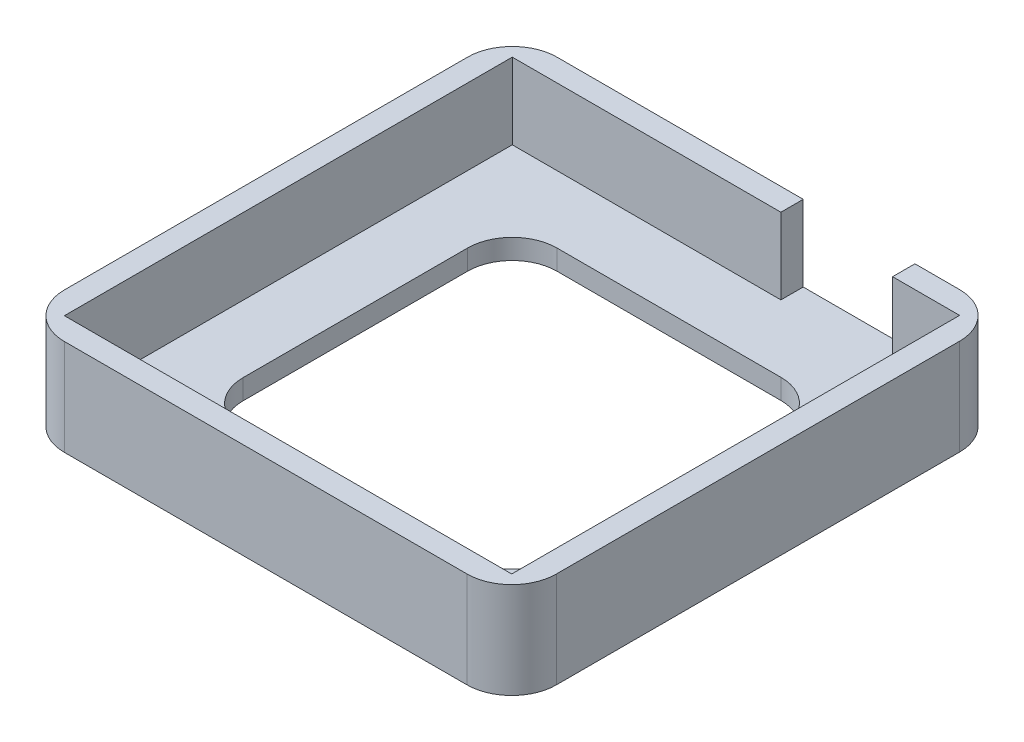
ISO-10303-21;
HEADER;
FILE_DESCRIPTION(('STEP AP214'),'2;1');
FILE_NAME('part.step','',(''),(''),'','','');
FILE_SCHEMA(('AUTOMOTIVE_DESIGN { 1 0 10303 214 1 1 1 1 }'));
ENDSEC;
DATA;
#1=APPLICATION_CONTEXT('core data for automotive mechanical design processes');
#2=APPLICATION_PROTOCOL_DEFINITION('international standard','automotive_design',2000,#1);
#3=PRODUCT_CONTEXT('',#1,'mechanical');
#4=PRODUCT('Part','Part','',(#3));
#5=PRODUCT_RELATED_PRODUCT_CATEGORY('part','',(#4));
#6=PRODUCT_DEFINITION_FORMATION('','',#4);
#7=PRODUCT_DEFINITION_CONTEXT('part definition',#1,'design');
#8=PRODUCT_DEFINITION('design','',#6,#7);
#9=PRODUCT_DEFINITION_SHAPE('','',#8);
#10=(LENGTH_UNIT() NAMED_UNIT(*) SI_UNIT(.MILLI.,.METRE.));
#11=(NAMED_UNIT(*) PLANE_ANGLE_UNIT() SI_UNIT($,.RADIAN.));
#12=(NAMED_UNIT(*) SI_UNIT($,.STERADIAN.) SOLID_ANGLE_UNIT());
#13=UNCERTAINTY_MEASURE_WITH_UNIT(LENGTH_MEASURE(1.E-05),#10,'distance_accuracy_value','');
#14=(GEOMETRIC_REPRESENTATION_CONTEXT(3) GLOBAL_UNCERTAINTY_ASSIGNED_CONTEXT((#13)) GLOBAL_UNIT_ASSIGNED_CONTEXT((#10,
#11,#12)) REPRESENTATION_CONTEXT('',''));
#15=CARTESIAN_POINT('',(0.,0.,0.));
#16=DIRECTION('',(0.,0.,1.));
#17=DIRECTION('',(1.,0.,0.));
#18=AXIS2_PLACEMENT_3D('',#15,#16,#17);
#19=CARTESIAN_POINT('',(-2.55226231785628E-13,-166.578681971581,-50.1250000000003));
#20=DIRECTION('',(0.,0.,1.));
#21=DIRECTION('',(1.,0.,0.));
#22=AXIS2_PLACEMENT_3D('',#19,#20,#21);
#23=PLANE('',#22);
#24=DIRECTION('',(0.,-1.,0.));
#25=VECTOR('',#24,1.);
#26=CARTESIAN_POINT('',(10.0625,10.75,-50.1250000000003));
#27=LINE('',#26,#25);
#28=CARTESIAN_POINT('',(10.0625,10.75,-50.1250000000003));
#29=VERTEX_POINT('',#28);
#30=CARTESIAN_POINT('',(10.0625,-6.25000000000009,-50.1250000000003));
#31=VERTEX_POINT('',#30);
#32=EDGE_CURVE('E218',#29,#31,#27,.T.);
#33=ORIENTED_EDGE('',*,*,#32,.F.);
#34=DIRECTION('',(1.,0.,0.));
#35=VECTOR('',#34,1.);
#36=CARTESIAN_POINT('',(-2.79786409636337E-13,10.75,-50.1250000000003));
#37=LINE('',#36,#35);
#38=CARTESIAN_POINT('',(-50.0625,10.75,-50.125));
#39=VERTEX_POINT('',#38);
#40=EDGE_CURVE('E312',#39,#29,#37,.T.);
#41=ORIENTED_EDGE('',*,*,#40,.F.);
#42=DIRECTION('',(0.,1.,0.));
#43=VECTOR('',#42,1.);
#44=CARTESIAN_POINT('',(-50.0625,-166.578681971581,-50.125));
#45=LINE('',#44,#43);
#46=CARTESIAN_POINT('',(-50.0625,-6.25000000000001,-50.125));
#47=VERTEX_POINT('',#46);
#48=EDGE_CURVE('E337',#47,#39,#45,.T.);
#49=ORIENTED_EDGE('',*,*,#48,.F.);
#50=DIRECTION('',(-1.,0.,0.));
#51=VECTOR('',#50,1.);
#52=CARTESIAN_POINT('',(0.,-6.25000000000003,-50.125));
#53=LINE('',#52,#51);
#54=EDGE_CURVE('E348',#31,#47,#53,.T.);
#55=ORIENTED_EDGE('',*,*,#54,.F.);
#56=EDGE_LOOP('',(#33,#41,#49,#55));
#57=FACE_BOUND('',#56,.T.);
#58=ADVANCED_FACE('F49',(#57),#23,.T.);
#59=CARTESIAN_POINT('',(50.0625,-6.24999999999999,50.125));
#60=DIRECTION('',(0.,-1.,0.));
#61=DIRECTION('',(1.,0.,0.));
#62=AXIS2_PLACEMENT_3D('',#59,#60,#61);
#63=PLANE('',#62);
#64=DIRECTION('',(0.,0.,-1.));
#65=VECTOR('',#64,1.);
#66=CARTESIAN_POINT('',(50.0625,-6.25000000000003,0.));
#67=LINE('',#66,#65);
#68=CARTESIAN_POINT('',(50.0625,-6.25000000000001,50.125));
#69=VERTEX_POINT('',#68);
#70=CARTESIAN_POINT('',(50.0625,-6.25000000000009,-50.125));
#71=VERTEX_POINT('',#70);
#72=EDGE_CURVE('E353',#69,#71,#67,.T.);
#73=ORIENTED_EDGE('',*,*,#72,.T.);
#74=CARTESIAN_POINT('',(35.0625,-6.25000000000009,-50.1250000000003));
#75=VERTEX_POINT('',#74);
#76=EDGE_CURVE('E349',#71,#75,#53,.T.);
#77=ORIENTED_EDGE('',*,*,#76,.T.);
#78=DIRECTION('',(0.,0.,1.));
#79=VECTOR('',#78,1.);
#80=CARTESIAN_POINT('',(35.0625,-6.25000000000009,-55.125));
#81=LINE('',#80,#79);
#82=CARTESIAN_POINT('',(35.0625,-6.25000000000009,-55.125));
#83=VERTEX_POINT('',#82);
#84=EDGE_CURVE('E222',#83,#75,#81,.T.);
#85=ORIENTED_EDGE('',*,*,#84,.F.);
#86=DIRECTION('',(1.,0.,0.));
#87=VECTOR('',#86,1.);
#88=CARTESIAN_POINT('',(10.0625,-6.25000000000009,-55.125));
#89=LINE('',#88,#87);
#90=CARTESIAN_POINT('',(10.0625,-6.25000000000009,-55.125));
#91=VERTEX_POINT('',#90);
#92=EDGE_CURVE('E225',#91,#83,#89,.T.);
#93=ORIENTED_EDGE('',*,*,#92,.F.);
#94=DIRECTION('',(0.,0.,1.));
#95=VECTOR('',#94,1.);
#96=CARTESIAN_POINT('',(10.0625,-6.25000000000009,-55.125));
#97=LINE('',#96,#95);
#98=EDGE_CURVE('E211',#91,#31,#97,.T.);
#99=ORIENTED_EDGE('',*,*,#98,.T.);
#100=ORIENTED_EDGE('',*,*,#54,.T.);
#101=DIRECTION('',(0.,0.,1.));
#102=VECTOR('',#101,1.);
#103=CARTESIAN_POINT('',(-50.0625,-6.25000000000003,0.));
#104=LINE('',#103,#102);
#105=CARTESIAN_POINT('',(-50.0625,-6.25000000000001,50.1250000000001));
#106=VERTEX_POINT('',#105);
#107=EDGE_CURVE('E352',#47,#106,#104,.T.);
#108=ORIENTED_EDGE('',*,*,#107,.T.);
#109=DIRECTION('',(1.,0.,0.));
#110=VECTOR('',#109,1.);
#111=CARTESIAN_POINT('',(0.,-6.25000000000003,50.125));
#112=LINE('',#111,#110);
#113=EDGE_CURVE('E357',#106,#69,#112,.T.);
#114=ORIENTED_EDGE('',*,*,#113,.T.);
#115=EDGE_LOOP('',(#73,#77,#85,#93,#99,#100,#108,#114));
#116=FACE_BOUND('',#115,.T.);
#117=DIRECTION('',(0.,0.,1.));
#118=VECTOR('',#117,1.);
#119=CARTESIAN_POINT('',(-35.0625,-6.25000000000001,-35.125));
#120=LINE('',#119,#118);
#121=CARTESIAN_POINT('',(-35.0625,-6.25000000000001,-25.125));
#122=VERTEX_POINT('',#121);
#123=CARTESIAN_POINT('',(-35.0625,-6.25000000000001,25.125));
#124=VERTEX_POINT('',#123);
#125=EDGE_CURVE('E251',#122,#124,#120,.T.);
#126=ORIENTED_EDGE('',*,*,#125,.F.);
#127=CARTESIAN_POINT('',(-25.0625,-6.25,-25.125));
#128=DIRECTION('',(0.,-1.,0.));
#129=DIRECTION('',(1.,0.,0.));
#130=AXIS2_PLACEMENT_3D('',#127,#128,#129);
#131=CIRCLE('',#130,10.);
#132=CARTESIAN_POINT('',(-25.0625,-6.25,-35.125));
#133=VERTEX_POINT('',#132);
#134=EDGE_CURVE('E58',#122,#133,#131,.T.);
#135=ORIENTED_EDGE('',*,*,#134,.T.);
#136=DIRECTION('',(-1.,0.,0.));
#137=VECTOR('',#136,1.);
#138=CARTESIAN_POINT('',(35.0625,-6.25,-35.125));
#139=LINE('',#138,#137);
#140=CARTESIAN_POINT('',(25.0625,-6.25,-35.125));
#141=VERTEX_POINT('',#140);
#142=EDGE_CURVE('E263',#141,#133,#139,.T.);
#143=ORIENTED_EDGE('',*,*,#142,.F.);
#144=CARTESIAN_POINT('',(25.0625,-6.25,-25.125));
#145=DIRECTION('',(0.,-1.,0.));
#146=DIRECTION('',(1.,0.,0.));
#147=AXIS2_PLACEMENT_3D('',#144,#145,#146);
#148=CIRCLE('',#147,10.);
#149=CARTESIAN_POINT('',(35.0625,-6.25,-25.125));
#150=VERTEX_POINT('',#149);
#151=EDGE_CURVE('E454',#141,#150,#148,.T.);
#152=ORIENTED_EDGE('',*,*,#151,.T.);
#153=DIRECTION('',(0.,0.,-1.));
#154=VECTOR('',#153,1.);
#155=CARTESIAN_POINT('',(35.0625,-6.25,35.125));
#156=LINE('',#155,#154);
#157=CARTESIAN_POINT('',(35.0625,-6.25,25.125));
#158=VERTEX_POINT('',#157);
#159=EDGE_CURVE('E282',#158,#150,#156,.T.);
#160=ORIENTED_EDGE('',*,*,#159,.F.);
#161=CARTESIAN_POINT('',(25.0625,-6.25,25.125));
#162=DIRECTION('',(0.,-1.,0.));
#163=DIRECTION('',(1.,0.,0.));
#164=AXIS2_PLACEMENT_3D('',#161,#162,#163);
#165=CIRCLE('',#164,10.);
#166=CARTESIAN_POINT('',(25.0625,-6.25,35.125));
#167=VERTEX_POINT('',#166);
#168=EDGE_CURVE('E442',#158,#167,#165,.T.);
#169=ORIENTED_EDGE('',*,*,#168,.T.);
#170=DIRECTION('',(1.,0.,0.));
#171=VECTOR('',#170,1.);
#172=CARTESIAN_POINT('',(-35.0625,-6.25000000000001,35.125));
#173=LINE('',#172,#171);
#174=CARTESIAN_POINT('',(-25.0625,-6.25,35.125));
#175=VERTEX_POINT('',#174);
#176=EDGE_CURVE('E278',#175,#167,#173,.T.);
#177=ORIENTED_EDGE('',*,*,#176,.F.);
#178=CARTESIAN_POINT('',(-25.0625,-6.25,25.125));
#179=DIRECTION('',(0.,-1.,0.));
#180=DIRECTION('',(1.,0.,0.));
#181=AXIS2_PLACEMENT_3D('',#178,#179,#180);
#182=CIRCLE('',#181,10.);
#183=EDGE_CURVE('E448',#175,#124,#182,.T.);
#184=ORIENTED_EDGE('',*,*,#183,.T.);
#185=EDGE_LOOP('',(#126,#135,#143,#152,#160,#169,#177,#184));
#186=FACE_BOUND('',#185,.T.);
#187=ADVANCED_FACE('F227',(#116,#186),#63,.F.);
#188=CARTESIAN_POINT('',(50.0625,-10.75,50.125));
#189=DIRECTION('',(0.,-1.,0.));
#190=DIRECTION('',(1.,0.,0.));
#191=AXIS2_PLACEMENT_3D('',#188,#189,#190);
#192=PLANE('',#191);
#193=DIRECTION('',(-1.,0.,0.));
#194=VECTOR('',#193,1.);
#195=CARTESIAN_POINT('',(35.0625,-10.75,-35.125));
#196=LINE('',#195,#194);
#197=CARTESIAN_POINT('',(25.0625,-10.75,-35.125));
#198=VERTEX_POINT('',#197);
#199=CARTESIAN_POINT('',(-25.0625,-10.75,-35.125));
#200=VERTEX_POINT('',#199);
#201=EDGE_CURVE('E271',#198,#200,#196,.T.);
#202=ORIENTED_EDGE('',*,*,#201,.T.);
#203=CARTESIAN_POINT('',(-25.0625,-10.75,-25.125));
#204=DIRECTION('',(0.,-1.,0.));
#205=DIRECTION('',(1.,0.,0.));
#206=AXIS2_PLACEMENT_3D('',#203,#204,#205);
#207=CIRCLE('',#206,10.);
#208=CARTESIAN_POINT('',(-35.0625,-10.75,-25.125));
#209=VERTEX_POINT('',#208);
#210=EDGE_CURVE('E12',#200,#209,#207,.F.);
#211=ORIENTED_EDGE('',*,*,#210,.T.);
#212=DIRECTION('',(0.,0.,1.));
#213=VECTOR('',#212,1.);
#214=CARTESIAN_POINT('',(-35.0625,-10.75,-35.125));
#215=LINE('',#214,#213);
#216=CARTESIAN_POINT('',(-35.0625,-10.75,25.125));
#217=VERTEX_POINT('',#216);
#218=EDGE_CURVE('E258',#209,#217,#215,.T.);
#219=ORIENTED_EDGE('',*,*,#218,.T.);
#220=CARTESIAN_POINT('',(-25.0625,-10.75,25.125));
#221=DIRECTION('',(0.,-1.,0.));
#222=DIRECTION('',(1.,0.,0.));
#223=AXIS2_PLACEMENT_3D('',#220,#221,#222);
#224=CIRCLE('',#223,10.);
#225=CARTESIAN_POINT('',(-25.0625,-10.75,35.125));
#226=VERTEX_POINT('',#225);
#227=EDGE_CURVE('E451',#217,#226,#224,.F.);
#228=ORIENTED_EDGE('',*,*,#227,.T.);
#229=DIRECTION('',(1.,0.,0.));
#230=VECTOR('',#229,1.);
#231=CARTESIAN_POINT('',(-35.0625,-10.75,35.125));
#232=LINE('',#231,#230);
#233=CARTESIAN_POINT('',(25.0625,-10.75,35.125));
#234=VERTEX_POINT('',#233);
#235=EDGE_CURVE('E262',#226,#234,#232,.T.);
#236=ORIENTED_EDGE('',*,*,#235,.T.);
#237=CARTESIAN_POINT('',(25.0625,-10.75,25.125));
#238=DIRECTION('',(0.,-1.,0.));
#239=DIRECTION('',(1.,0.,0.));
#240=AXIS2_PLACEMENT_3D('',#237,#238,#239);
#241=CIRCLE('',#240,10.);
#242=CARTESIAN_POINT('',(35.0625,-10.75,25.125));
#243=VERTEX_POINT('',#242);
#244=EDGE_CURVE('E445',#234,#243,#241,.F.);
#245=ORIENTED_EDGE('',*,*,#244,.T.);
#246=DIRECTION('',(0.,0.,-1.));
#247=VECTOR('',#246,1.);
#248=CARTESIAN_POINT('',(35.0625,-10.75,35.125));
#249=LINE('',#248,#247);
#250=CARTESIAN_POINT('',(35.0625,-10.75,-25.125));
#251=VERTEX_POINT('',#250);
#252=EDGE_CURVE('E267',#243,#251,#249,.T.);
#253=ORIENTED_EDGE('',*,*,#252,.T.);
#254=CARTESIAN_POINT('',(25.0625,-10.75,-25.125));
#255=DIRECTION('',(0.,-1.,0.));
#256=DIRECTION('',(1.,0.,0.));
#257=AXIS2_PLACEMENT_3D('',#254,#255,#256);
#258=CIRCLE('',#257,10.);
#259=EDGE_CURVE('E457',#251,#198,#258,.F.);
#260=ORIENTED_EDGE('',*,*,#259,.T.);
#261=EDGE_LOOP('',(#202,#211,#219,#228,#236,#245,#253,#260));
#262=FACE_BOUND('',#261,.T.);
#263=DIRECTION('',(1.,0.,0.));
#264=VECTOR('',#263,1.);
#265=CARTESIAN_POINT('',(0.,-10.75,-55.125));
#266=LINE('',#265,#264);
#267=CARTESIAN_POINT('',(-45.0625,-10.75,-55.125));
#268=VERTEX_POINT('',#267);
#269=CARTESIAN_POINT('',(45.0625,-10.75,-55.125));
#270=VERTEX_POINT('',#269);
#271=EDGE_CURVE('E291',#268,#270,#266,.T.);
#272=ORIENTED_EDGE('',*,*,#271,.T.);
#273=CARTESIAN_POINT('',(45.0625,-10.75,-45.125));
#274=DIRECTION('',(0.,-1.,0.));
#275=DIRECTION('',(1.,0.,0.));
#276=AXIS2_PLACEMENT_3D('',#273,#274,#275);
#277=CIRCLE('',#276,10.);
#278=CARTESIAN_POINT('',(55.0625,-10.75,-45.125));
#279=VERTEX_POINT('',#278);
#280=EDGE_CURVE('E398',#270,#279,#277,.T.);
#281=ORIENTED_EDGE('',*,*,#280,.T.);
#282=DIRECTION('',(0.,0.,-1.));
#283=VECTOR('',#282,1.);
#284=CARTESIAN_POINT('',(55.0625000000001,-10.75,0.));
#285=LINE('',#284,#283);
#286=CARTESIAN_POINT('',(55.0625000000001,-10.75,45.125));
#287=VERTEX_POINT('',#286);
#288=EDGE_CURVE('E274',#287,#279,#285,.T.);
#289=ORIENTED_EDGE('',*,*,#288,.F.);
#290=CARTESIAN_POINT('',(45.0625000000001,-10.75,45.125));
#291=DIRECTION('',(0.,-1.,0.));
#292=DIRECTION('',(1.,0.,0.));
#293=AXIS2_PLACEMENT_3D('',#290,#291,#292);
#294=CIRCLE('',#293,10.);
#295=CARTESIAN_POINT('',(45.0625000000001,-10.75,55.125));
#296=VERTEX_POINT('',#295);
#297=EDGE_CURVE('E395',#287,#296,#294,.T.);
#298=ORIENTED_EDGE('',*,*,#297,.T.);
#299=DIRECTION('',(1.,0.,0.));
#300=VECTOR('',#299,1.);
#301=CARTESIAN_POINT('',(0.,-10.75,55.125));
#302=LINE('',#301,#300);
#303=CARTESIAN_POINT('',(-45.0625,-10.75,55.125));
#304=VERTEX_POINT('',#303);
#305=EDGE_CURVE('E336',#304,#296,#302,.T.);
#306=ORIENTED_EDGE('',*,*,#305,.F.);
#307=CARTESIAN_POINT('',(-45.0625,-10.75,45.125));
#308=DIRECTION('',(0.,-1.,0.));
#309=DIRECTION('',(1.,0.,0.));
#310=AXIS2_PLACEMENT_3D('',#307,#308,#309);
#311=CIRCLE('',#310,10.);
#312=CARTESIAN_POINT('',(-55.0625,-10.75,45.125));
#313=VERTEX_POINT('',#312);
#314=EDGE_CURVE('E392',#304,#313,#311,.T.);
#315=ORIENTED_EDGE('',*,*,#314,.T.);
#316=DIRECTION('',(0.,0.,1.));
#317=VECTOR('',#316,1.);
#318=CARTESIAN_POINT('',(-55.0625,-10.75,0.));
#319=LINE('',#318,#317);
#320=CARTESIAN_POINT('',(-55.0625,-10.75,-45.125));
#321=VERTEX_POINT('',#320);
#322=EDGE_CURVE('E295',#321,#313,#319,.T.);
#323=ORIENTED_EDGE('',*,*,#322,.F.);
#324=CARTESIAN_POINT('',(-45.0625,-10.75,-45.125));
#325=DIRECTION('',(0.,-1.,0.));
#326=DIRECTION('',(1.,0.,0.));
#327=AXIS2_PLACEMENT_3D('',#324,#325,#326);
#328=CIRCLE('',#327,10.);
#329=EDGE_CURVE('E389',#321,#268,#328,.T.);
#330=ORIENTED_EDGE('',*,*,#329,.T.);
#331=EDGE_LOOP('',(#272,#281,#289,#298,#306,#315,#323,#330));
#332=FACE_BOUND('',#331,.T.);
#333=ADVANCED_FACE('F469',(#262,#332),#192,.T.);
#334=CARTESIAN_POINT('',(1.62148236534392E-13,-166.578681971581,50.1250000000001));
#335=DIRECTION('',(0.,0.,-1.));
#336=DIRECTION('',(-1.,0.,0.));
#337=AXIS2_PLACEMENT_3D('',#334,#335,#336);
#338=PLANE('',#337);
#339=ORIENTED_EDGE('',*,*,#113,.F.);
#340=DIRECTION('',(0.,1.,0.));
#341=VECTOR('',#340,1.);
#342=CARTESIAN_POINT('',(-50.0625,-166.578681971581,50.1250000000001));
#343=LINE('',#342,#341);
#344=CARTESIAN_POINT('',(-50.0625,10.75,50.1250000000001));
#345=VERTEX_POINT('',#344);
#346=EDGE_CURVE('E340',#106,#345,#343,.T.);
#347=ORIENTED_EDGE('',*,*,#346,.T.);
#348=DIRECTION('',(-1.,0.,0.));
#349=VECTOR('',#348,1.);
#350=CARTESIAN_POINT('',(1.37588058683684E-13,10.75,50.1250000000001));
#351=LINE('',#350,#349);
#352=CARTESIAN_POINT('',(50.0625,10.75,50.125));
#353=VERTEX_POINT('',#352);
#354=EDGE_CURVE('E303',#353,#345,#351,.T.);
#355=ORIENTED_EDGE('',*,*,#354,.F.);
#356=DIRECTION('',(0.,1.,0.));
#357=VECTOR('',#356,1.);
#358=CARTESIAN_POINT('',(50.0625,-166.578681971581,50.125));
#359=LINE('',#358,#357);
#360=EDGE_CURVE('E331',#69,#353,#359,.T.);
#361=ORIENTED_EDGE('',*,*,#360,.F.);
#362=EDGE_LOOP('',(#339,#347,#355,#361));
#363=FACE_BOUND('',#362,.T.);
#364=ADVANCED_FACE('F523',(#363),#338,.T.);
#365=CARTESIAN_POINT('',(-50.0625,-166.578681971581,0.));
#366=DIRECTION('',(-1.,0.,0.));
#367=DIRECTION('',(0.,-1.,0.));
#368=AXIS2_PLACEMENT_3D('',#365,#366,#367);
#369=PLANE('',#368);
#370=ORIENTED_EDGE('',*,*,#346,.F.);
#371=ORIENTED_EDGE('',*,*,#107,.F.);
#372=ORIENTED_EDGE('',*,*,#48,.T.);
#373=DIRECTION('',(0.,0.,1.));
#374=VECTOR('',#373,1.);
#375=CARTESIAN_POINT('',(-50.0625,10.75,0.));
#376=LINE('',#375,#374);
#377=EDGE_CURVE('E307',#39,#345,#376,.T.);
#378=ORIENTED_EDGE('',*,*,#377,.T.);
#379=EDGE_LOOP('',(#370,#371,#372,#378));
#380=FACE_BOUND('',#379,.T.);
#381=ADVANCED_FACE('F513',(#380),#369,.F.);
#382=DIRECTION('',(0.,1.,0.));
#383=VECTOR('',#382,1.);
#384=CARTESIAN_POINT('',(35.0625,10.75,-50.1250000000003));
#385=LINE('',#384,#383);
#386=CARTESIAN_POINT('',(35.0625,10.75,-50.1250000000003));
#387=VERTEX_POINT('',#386);
#388=EDGE_CURVE('E239',#75,#387,#385,.T.);
#389=ORIENTED_EDGE('',*,*,#388,.F.);
#390=ORIENTED_EDGE('',*,*,#76,.F.);
#391=DIRECTION('',(0.,1.,0.));
#392=VECTOR('',#391,1.);
#393=CARTESIAN_POINT('',(50.0625,-166.578681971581,-50.1250000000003));
#394=LINE('',#393,#392);
#395=CARTESIAN_POINT('',(50.0625,10.75,-50.1250000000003));
#396=VERTEX_POINT('',#395);
#397=EDGE_CURVE('E332',#71,#396,#394,.T.);
#398=ORIENTED_EDGE('',*,*,#397,.T.);
#399=EDGE_CURVE('E311',#387,#396,#37,.T.);
#400=ORIENTED_EDGE('',*,*,#399,.F.);
#401=EDGE_LOOP('',(#389,#390,#398,#400));
#402=FACE_BOUND('',#401,.T.);
#403=ADVANCED_FACE('F504',(#402),#23,.T.);
#404=CARTESIAN_POINT('',(50.0625,-166.578681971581,0.));
#405=DIRECTION('',(1.,0.,0.));
#406=DIRECTION('',(0.,1.,0.));
#407=AXIS2_PLACEMENT_3D('',#404,#405,#406);
#408=PLANE('',#407);
#409=ORIENTED_EDGE('',*,*,#397,.F.);
#410=ORIENTED_EDGE('',*,*,#72,.F.);
#411=ORIENTED_EDGE('',*,*,#360,.T.);
#412=DIRECTION('',(0.,0.,-1.));
#413=VECTOR('',#412,1.);
#414=CARTESIAN_POINT('',(50.0625,10.75,0.));
#415=LINE('',#414,#413);
#416=EDGE_CURVE('E299',#353,#396,#415,.T.);
#417=ORIENTED_EDGE('',*,*,#416,.T.);
#418=EDGE_LOOP('',(#409,#410,#411,#417));
#419=FACE_BOUND('',#418,.T.);
#420=ADVANCED_FACE('F512',(#419),#408,.F.);
#421=CARTESIAN_POINT('',(0.,10.75,0.));
#422=DIRECTION('',(0.,1.,0.));
#423=DIRECTION('',(-1.,0.,0.));
#424=AXIS2_PLACEMENT_3D('',#421,#422,#423);
#425=PLANE('',#424);
#426=DIRECTION('',(0.,0.,1.));
#427=VECTOR('',#426,1.);
#428=CARTESIAN_POINT('',(10.0625,10.75,-55.125));
#429=LINE('',#428,#427);
#430=CARTESIAN_POINT('',(10.0625,10.75,-55.125));
#431=VERTEX_POINT('',#430);
#432=EDGE_CURVE('E248',#431,#29,#429,.T.);
#433=ORIENTED_EDGE('',*,*,#432,.F.);
#434=DIRECTION('',(1.,0.,0.));
#435=VECTOR('',#434,1.);
#436=CARTESIAN_POINT('',(0.,10.75,-55.125));
#437=LINE('',#436,#435);
#438=CARTESIAN_POINT('',(-45.0625,10.75,-55.125));
#439=VERTEX_POINT('',#438);
#440=EDGE_CURVE('E237',#439,#431,#437,.T.);
#441=ORIENTED_EDGE('',*,*,#440,.F.);
#442=CARTESIAN_POINT('',(-45.0625,10.75,-45.125));
#443=DIRECTION('',(0.,1.,0.));
#444=DIRECTION('',(-1.,0.,0.));
#445=AXIS2_PLACEMENT_3D('',#442,#443,#444);
#446=CIRCLE('',#445,10.);
#447=CARTESIAN_POINT('',(-55.0625,10.75,-45.125));
#448=VERTEX_POINT('',#447);
#449=EDGE_CURVE('E370',#439,#448,#446,.T.);
#450=ORIENTED_EDGE('',*,*,#449,.T.);
#451=DIRECTION('',(0.,0.,1.));
#452=VECTOR('',#451,1.);
#453=CARTESIAN_POINT('',(-55.0625,10.75,0.));
#454=LINE('',#453,#452);
#455=CARTESIAN_POINT('',(-55.0625,10.75,45.125));
#456=VERTEX_POINT('',#455);
#457=EDGE_CURVE('E316',#448,#456,#454,.T.);
#458=ORIENTED_EDGE('',*,*,#457,.T.);
#459=CARTESIAN_POINT('',(-45.0625,10.75,45.125));
#460=DIRECTION('',(0.,1.,0.));
#461=DIRECTION('',(-1.,0.,0.));
#462=AXIS2_PLACEMENT_3D('',#459,#460,#461);
#463=CIRCLE('',#462,10.);
#464=CARTESIAN_POINT('',(-45.0625,10.75,55.125));
#465=VERTEX_POINT('',#464);
#466=EDGE_CURVE('E373',#456,#465,#463,.T.);
#467=ORIENTED_EDGE('',*,*,#466,.T.);
#468=DIRECTION('',(1.,0.,0.));
#469=VECTOR('',#468,1.);
#470=CARTESIAN_POINT('',(0.,10.75,55.125));
#471=LINE('',#470,#469);
#472=CARTESIAN_POINT('',(45.0625000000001,10.75,55.125));
#473=VERTEX_POINT('',#472);
#474=EDGE_CURVE('E320',#465,#473,#471,.T.);
#475=ORIENTED_EDGE('',*,*,#474,.T.);
#476=CARTESIAN_POINT('',(45.0625000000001,10.75,45.125));
#477=DIRECTION('',(0.,1.,0.));
#478=DIRECTION('',(-1.,0.,0.));
#479=AXIS2_PLACEMENT_3D('',#476,#477,#478);
#480=CIRCLE('',#479,10.);
#481=CARTESIAN_POINT('',(55.0625000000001,10.75,45.125));
#482=VERTEX_POINT('',#481);
#483=EDGE_CURVE('E376',#473,#482,#480,.T.);
#484=ORIENTED_EDGE('',*,*,#483,.T.);
#485=DIRECTION('',(0.,0.,-1.));
#486=VECTOR('',#485,1.);
#487=CARTESIAN_POINT('',(55.0625000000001,10.75,0.));
#488=LINE('',#487,#486);
#489=CARTESIAN_POINT('',(55.0625,10.75,-45.125));
#490=VERTEX_POINT('',#489);
#491=EDGE_CURVE('E324',#482,#490,#488,.T.);
#492=ORIENTED_EDGE('',*,*,#491,.T.);
#493=CARTESIAN_POINT('',(45.0625,10.75,-45.125));
#494=DIRECTION('',(0.,1.,0.));
#495=DIRECTION('',(-1.,0.,0.));
#496=AXIS2_PLACEMENT_3D('',#493,#494,#495);
#497=CIRCLE('',#496,10.);
#498=CARTESIAN_POINT('',(45.0625,10.75,-55.125));
#499=VERTEX_POINT('',#498);
#500=EDGE_CURVE('E379',#490,#499,#497,.T.);
#501=ORIENTED_EDGE('',*,*,#500,.T.);
#502=CARTESIAN_POINT('',(35.0625,10.75,-55.125));
#503=VERTEX_POINT('',#502);
#504=EDGE_CURVE('E328',#503,#499,#437,.T.);
#505=ORIENTED_EDGE('',*,*,#504,.F.);
#506=DIRECTION('',(0.,0.,1.));
#507=VECTOR('',#506,1.);
#508=CARTESIAN_POINT('',(35.0625,10.75,-55.125));
#509=LINE('',#508,#507);
#510=EDGE_CURVE('E252',#503,#387,#509,.T.);
#511=ORIENTED_EDGE('',*,*,#510,.T.);
#512=ORIENTED_EDGE('',*,*,#399,.T.);
#513=ORIENTED_EDGE('',*,*,#416,.F.);
#514=ORIENTED_EDGE('',*,*,#354,.T.);
#515=ORIENTED_EDGE('',*,*,#377,.F.);
#516=ORIENTED_EDGE('',*,*,#40,.T.);
#517=EDGE_LOOP('',(#433,#441,#450,#458,#467,#475,#484,#492,#501,#505,#511,#512,#513,#514,#515,#516));
#518=FACE_BOUND('',#517,.T.);
#519=ADVANCED_FACE('F519',(#518),#425,.T.);
#520=CARTESIAN_POINT('',(0.,-166.578681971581,55.125));
#521=DIRECTION('',(0.,0.,1.));
#522=DIRECTION('',(1.,0.,0.));
#523=AXIS2_PLACEMENT_3D('',#520,#521,#522);
#524=PLANE('',#523);
#525=ORIENTED_EDGE('',*,*,#305,.T.);
#526=DIRECTION('',(0.,1.,0.));
#527=VECTOR('',#526,1.);
#528=CARTESIAN_POINT('',(45.0625000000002,-166.578681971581,55.125));
#529=LINE('',#528,#527);
#530=EDGE_CURVE('E404',#296,#473,#529,.T.);
#531=ORIENTED_EDGE('',*,*,#530,.T.);
#532=ORIENTED_EDGE('',*,*,#474,.F.);
#533=DIRECTION('',(0.,1.,0.));
#534=VECTOR('',#533,1.);
#535=CARTESIAN_POINT('',(-45.0625,-166.578681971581,55.125));
#536=LINE('',#535,#534);
#537=EDGE_CURVE('E401',#465,#304,#536,.F.);
#538=ORIENTED_EDGE('',*,*,#537,.T.);
#539=EDGE_LOOP('',(#525,#531,#532,#538));
#540=FACE_BOUND('',#539,.T.);
#541=ADVANCED_FACE('F570',(#540),#524,.T.);
#542=CARTESIAN_POINT('',(55.0625000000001,-166.578681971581,0.));
#543=DIRECTION('',(1.,0.,0.));
#544=DIRECTION('',(0.,0.,-1.));
#545=AXIS2_PLACEMENT_3D('',#542,#543,#544);
#546=PLANE('',#545);
#547=ORIENTED_EDGE('',*,*,#288,.T.);
#548=DIRECTION('',(0.,1.,0.));
#549=VECTOR('',#548,1.);
#550=CARTESIAN_POINT('',(55.0625,10.75,-45.125));
#551=LINE('',#550,#549);
#552=EDGE_CURVE('E366',#279,#490,#551,.T.);
#553=ORIENTED_EDGE('',*,*,#552,.T.);
#554=ORIENTED_EDGE('',*,*,#491,.F.);
#555=DIRECTION('',(0.,1.,0.));
#556=VECTOR('',#555,1.);
#557=CARTESIAN_POINT('',(55.0625000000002,-166.578681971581,45.125));
#558=LINE('',#557,#556);
#559=EDGE_CURVE('E356',#482,#287,#558,.F.);
#560=ORIENTED_EDGE('',*,*,#559,.T.);
#561=EDGE_LOOP('',(#547,#553,#554,#560));
#562=FACE_BOUND('',#561,.T.);
#563=ADVANCED_FACE('F561',(#562),#546,.T.);
#564=CARTESIAN_POINT('',(0.,-166.578681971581,-55.125));
#565=DIRECTION('',(0.,0.,1.));
#566=DIRECTION('',(1.,0.,0.));
#567=AXIS2_PLACEMENT_3D('',#564,#565,#566);
#568=PLANE('',#567);
#569=ORIENTED_EDGE('',*,*,#440,.T.);
#570=DIRECTION('',(0.,-1.,0.));
#571=VECTOR('',#570,1.);
#572=CARTESIAN_POINT('',(10.0625,10.75,-55.125));
#573=LINE('',#572,#571);
#574=EDGE_CURVE('E215',#431,#91,#573,.T.);
#575=ORIENTED_EDGE('',*,*,#574,.T.);
#576=ORIENTED_EDGE('',*,*,#92,.T.);
#577=DIRECTION('',(0.,1.,0.));
#578=VECTOR('',#577,1.);
#579=CARTESIAN_POINT('',(35.0625,10.75,-55.125));
#580=LINE('',#579,#578);
#581=EDGE_CURVE('E65',#83,#503,#580,.T.);
#582=ORIENTED_EDGE('',*,*,#581,.T.);
#583=ORIENTED_EDGE('',*,*,#504,.T.);
#584=DIRECTION('',(0.,1.,0.));
#585=VECTOR('',#584,1.);
#586=CARTESIAN_POINT('',(45.0625,-10.75,-55.125));
#587=LINE('',#586,#585);
#588=EDGE_CURVE('E386',#499,#270,#587,.F.);
#589=ORIENTED_EDGE('',*,*,#588,.T.);
#590=ORIENTED_EDGE('',*,*,#271,.F.);
#591=DIRECTION('',(0.,1.,0.));
#592=VECTOR('',#591,1.);
#593=CARTESIAN_POINT('',(-45.0625,10.75,-55.125));
#594=LINE('',#593,#592);
#595=EDGE_CURVE('E383',#268,#439,#594,.T.);
#596=ORIENTED_EDGE('',*,*,#595,.T.);
#597=EDGE_LOOP('',(#569,#575,#576,#582,#583,#589,#590,#596));
#598=FACE_BOUND('',#597,.T.);
#599=ADVANCED_FACE('F234',(#598),#568,.F.);
#600=CARTESIAN_POINT('',(-55.0625,-166.578681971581,0.));
#601=DIRECTION('',(-1.,0.,0.));
#602=DIRECTION('',(0.,0.,1.));
#603=AXIS2_PLACEMENT_3D('',#600,#601,#602);
#604=PLANE('',#603);
#605=ORIENTED_EDGE('',*,*,#322,.T.);
#606=DIRECTION('',(0.,1.,0.));
#607=VECTOR('',#606,1.);
#608=CARTESIAN_POINT('',(-55.0625,-166.578681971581,45.125));
#609=LINE('',#608,#607);
#610=EDGE_CURVE('E411',#313,#456,#609,.T.);
#611=ORIENTED_EDGE('',*,*,#610,.T.);
#612=ORIENTED_EDGE('',*,*,#457,.F.);
#613=DIRECTION('',(0.,1.,0.));
#614=VECTOR('',#613,1.);
#615=CARTESIAN_POINT('',(-55.0625,-10.75,-45.125));
#616=LINE('',#615,#614);
#617=EDGE_CURVE('E408',#448,#321,#616,.F.);
#618=ORIENTED_EDGE('',*,*,#617,.T.);
#619=EDGE_LOOP('',(#605,#611,#612,#618));
#620=FACE_BOUND('',#619,.T.);
#621=ADVANCED_FACE('F547',(#620),#604,.T.);
#622=CARTESIAN_POINT('',(45.0625,-166.578681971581,-45.125));
#623=DIRECTION('',(0.,-1.,0.));
#624=DIRECTION('',(1.,0.,0.));
#625=AXIS2_PLACEMENT_3D('',#622,#623,#624);
#626=CYLINDRICAL_SURFACE('',#625,10.);
#627=ORIENTED_EDGE('',*,*,#280,.F.);
#628=ORIENTED_EDGE('',*,*,#588,.F.);
#629=ORIENTED_EDGE('',*,*,#500,.F.);
#630=ORIENTED_EDGE('',*,*,#552,.F.);
#631=EDGE_LOOP('',(#627,#628,#629,#630));
#632=FACE_BOUND('',#631,.T.);
#633=ADVANCED_FACE('F556',(#632),#626,.T.);
#634=CARTESIAN_POINT('',(45.0625000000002,-166.578681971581,45.125));
#635=DIRECTION('',(0.,1.,0.));
#636=DIRECTION('',(-1.,0.,0.));
#637=AXIS2_PLACEMENT_3D('',#634,#635,#636);
#638=CYLINDRICAL_SURFACE('',#637,10.);
#639=ORIENTED_EDGE('',*,*,#297,.F.);
#640=ORIENTED_EDGE('',*,*,#559,.F.);
#641=ORIENTED_EDGE('',*,*,#483,.F.);
#642=ORIENTED_EDGE('',*,*,#530,.F.);
#643=EDGE_LOOP('',(#639,#640,#641,#642));
#644=FACE_BOUND('',#643,.T.);
#645=ADVANCED_FACE('F565',(#644),#638,.T.);
#646=CARTESIAN_POINT('',(-45.0625,-166.578681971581,45.125));
#647=DIRECTION('',(0.,1.,0.));
#648=DIRECTION('',(-1.,0.,0.));
#649=AXIS2_PLACEMENT_3D('',#646,#647,#648);
#650=CYLINDRICAL_SURFACE('',#649,10.);
#651=ORIENTED_EDGE('',*,*,#314,.F.);
#652=ORIENTED_EDGE('',*,*,#537,.F.);
#653=ORIENTED_EDGE('',*,*,#466,.F.);
#654=ORIENTED_EDGE('',*,*,#610,.F.);
#655=EDGE_LOOP('',(#651,#652,#653,#654));
#656=FACE_BOUND('',#655,.T.);
#657=ADVANCED_FACE('F574',(#656),#650,.T.);
#658=CARTESIAN_POINT('',(-45.0625,-166.578681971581,-45.125));
#659=DIRECTION('',(0.,-1.,0.));
#660=DIRECTION('',(1.,0.,0.));
#661=AXIS2_PLACEMENT_3D('',#658,#659,#660);
#662=CYLINDRICAL_SURFACE('',#661,10.);
#663=ORIENTED_EDGE('',*,*,#329,.F.);
#664=ORIENTED_EDGE('',*,*,#617,.F.);
#665=ORIENTED_EDGE('',*,*,#449,.F.);
#666=ORIENTED_EDGE('',*,*,#595,.F.);
#667=EDGE_LOOP('',(#663,#664,#665,#666));
#668=FACE_BOUND('',#667,.T.);
#669=ADVANCED_FACE('F551',(#668),#662,.T.);
#670=CARTESIAN_POINT('',(-35.0625,-10.75,-35.125));
#671=DIRECTION('',(-1.,0.,0.));
#672=DIRECTION('',(0.,-1.,0.));
#673=AXIS2_PLACEMENT_3D('',#670,#671,#672);
#674=PLANE('',#673);
#675=ORIENTED_EDGE('',*,*,#125,.T.);
#676=DIRECTION('',(0.,1.,0.));
#677=VECTOR('',#676,1.);
#678=CARTESIAN_POINT('',(-35.0625,-10.75,25.125));
#679=LINE('',#678,#677);
#680=EDGE_CURVE('E433',#124,#217,#679,.F.);
#681=ORIENTED_EDGE('',*,*,#680,.T.);
#682=ORIENTED_EDGE('',*,*,#218,.F.);
#683=DIRECTION('',(0.,1.,0.));
#684=VECTOR('',#683,1.);
#685=CARTESIAN_POINT('',(-35.0625,-6.25000000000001,-25.125));
#686=LINE('',#685,#684);
#687=EDGE_CURVE('E429',#209,#122,#686,.T.);
#688=ORIENTED_EDGE('',*,*,#687,.T.);
#689=EDGE_LOOP('',(#675,#681,#682,#688));
#690=FACE_BOUND('',#689,.T.);
#691=ADVANCED_FACE('F473',(#690),#674,.F.);
#692=CARTESIAN_POINT('',(35.0625,-10.75,-35.125));
#693=DIRECTION('',(0.,0.,-1.));
#694=DIRECTION('',(-1.,0.,0.));
#695=AXIS2_PLACEMENT_3D('',#692,#693,#694);
#696=PLANE('',#695);
#697=ORIENTED_EDGE('',*,*,#201,.F.);
#698=DIRECTION('',(0.,1.,0.));
#699=VECTOR('',#698,1.);
#700=CARTESIAN_POINT('',(25.0625,-6.25,-35.125));
#701=LINE('',#700,#699);
#702=EDGE_CURVE('E438',#198,#141,#701,.T.);
#703=ORIENTED_EDGE('',*,*,#702,.T.);
#704=ORIENTED_EDGE('',*,*,#142,.T.);
#705=DIRECTION('',(0.,1.,0.));
#706=VECTOR('',#705,1.);
#707=CARTESIAN_POINT('',(-25.0625,-10.75,-35.125));
#708=LINE('',#707,#706);
#709=EDGE_CURVE('E73',#133,#200,#708,.F.);
#710=ORIENTED_EDGE('',*,*,#709,.T.);
#711=EDGE_LOOP('',(#697,#703,#704,#710));
#712=FACE_BOUND('',#711,.T.);
#713=ADVANCED_FACE('F464',(#712),#696,.F.);
#714=CARTESIAN_POINT('',(35.0625,-10.75,35.125));
#715=DIRECTION('',(1.,0.,0.));
#716=DIRECTION('',(0.,1.,0.));
#717=AXIS2_PLACEMENT_3D('',#714,#715,#716);
#718=PLANE('',#717);
#719=ORIENTED_EDGE('',*,*,#252,.F.);
#720=DIRECTION('',(0.,1.,0.));
#721=VECTOR('',#720,1.);
#722=CARTESIAN_POINT('',(35.0625,-6.25,25.125));
#723=LINE('',#722,#721);
#724=EDGE_CURVE('E418',#243,#158,#723,.T.);
#725=ORIENTED_EDGE('',*,*,#724,.T.);
#726=ORIENTED_EDGE('',*,*,#159,.T.);
#727=DIRECTION('',(0.,1.,0.));
#728=VECTOR('',#727,1.);
#729=CARTESIAN_POINT('',(35.0625,-10.75,-25.125));
#730=LINE('',#729,#728);
#731=EDGE_CURVE('E415',#150,#251,#730,.F.);
#732=ORIENTED_EDGE('',*,*,#731,.T.);
#733=EDGE_LOOP('',(#719,#725,#726,#732));
#734=FACE_BOUND('',#733,.T.);
#735=ADVANCED_FACE('F490',(#734),#718,.F.);
#736=CARTESIAN_POINT('',(-35.0625,-10.75,35.125));
#737=DIRECTION('',(0.,0.,1.));
#738=DIRECTION('',(1.,0.,0.));
#739=AXIS2_PLACEMENT_3D('',#736,#737,#738);
#740=PLANE('',#739);
#741=ORIENTED_EDGE('',*,*,#176,.T.);
#742=DIRECTION('',(0.,1.,0.));
#743=VECTOR('',#742,1.);
#744=CARTESIAN_POINT('',(25.0625,-10.75,35.125));
#745=LINE('',#744,#743);
#746=EDGE_CURVE('E426',#167,#234,#745,.F.);
#747=ORIENTED_EDGE('',*,*,#746,.T.);
#748=ORIENTED_EDGE('',*,*,#235,.F.);
#749=DIRECTION('',(0.,1.,0.));
#750=VECTOR('',#749,1.);
#751=CARTESIAN_POINT('',(-25.0625,-6.25,35.125));
#752=LINE('',#751,#750);
#753=EDGE_CURVE('E422',#226,#175,#752,.T.);
#754=ORIENTED_EDGE('',*,*,#753,.T.);
#755=EDGE_LOOP('',(#741,#747,#748,#754));
#756=FACE_BOUND('',#755,.T.);
#757=ADVANCED_FACE('F481',(#756),#740,.F.);
#758=CARTESIAN_POINT('',(25.0625,-10.75,25.125));
#759=DIRECTION('',(0.,-1.,0.));
#760=DIRECTION('',(1.,0.,0.));
#761=AXIS2_PLACEMENT_3D('',#758,#759,#760);
#762=CYLINDRICAL_SURFACE('',#761,10.);
#763=ORIENTED_EDGE('',*,*,#244,.F.);
#764=ORIENTED_EDGE('',*,*,#746,.F.);
#765=ORIENTED_EDGE('',*,*,#168,.F.);
#766=ORIENTED_EDGE('',*,*,#724,.F.);
#767=EDGE_LOOP('',(#763,#764,#765,#766));
#768=FACE_BOUND('',#767,.T.);
#769=ADVANCED_FACE('F485',(#768),#762,.F.);
#770=CARTESIAN_POINT('',(-25.0625,-10.75,25.125));
#771=DIRECTION('',(0.,-1.,0.));
#772=DIRECTION('',(1.,0.,0.));
#773=AXIS2_PLACEMENT_3D('',#770,#771,#772);
#774=CYLINDRICAL_SURFACE('',#773,10.);
#775=ORIENTED_EDGE('',*,*,#227,.F.);
#776=ORIENTED_EDGE('',*,*,#680,.F.);
#777=ORIENTED_EDGE('',*,*,#183,.F.);
#778=ORIENTED_EDGE('',*,*,#753,.F.);
#779=EDGE_LOOP('',(#775,#776,#777,#778));
#780=FACE_BOUND('',#779,.T.);
#781=ADVANCED_FACE('F476',(#780),#774,.F.);
#782=CARTESIAN_POINT('',(25.0625,-10.75,-25.125));
#783=DIRECTION('',(0.,-1.,0.));
#784=DIRECTION('',(1.,0.,0.));
#785=AXIS2_PLACEMENT_3D('',#782,#783,#784);
#786=CYLINDRICAL_SURFACE('',#785,10.);
#787=ORIENTED_EDGE('',*,*,#259,.F.);
#788=ORIENTED_EDGE('',*,*,#731,.F.);
#789=ORIENTED_EDGE('',*,*,#151,.F.);
#790=ORIENTED_EDGE('',*,*,#702,.F.);
#791=EDGE_LOOP('',(#787,#788,#789,#790));
#792=FACE_BOUND('',#791,.T.);
#793=ADVANCED_FACE('F494',(#792),#786,.F.);
#794=CARTESIAN_POINT('',(-25.0625,-10.75,-25.125));
#795=DIRECTION('',(0.,-1.,0.));
#796=DIRECTION('',(1.,0.,0.));
#797=AXIS2_PLACEMENT_3D('',#794,#795,#796);
#798=CYLINDRICAL_SURFACE('',#797,10.);
#799=ORIENTED_EDGE('',*,*,#210,.F.);
#800=ORIENTED_EDGE('',*,*,#709,.F.);
#801=ORIENTED_EDGE('',*,*,#134,.F.);
#802=ORIENTED_EDGE('',*,*,#687,.F.);
#803=EDGE_LOOP('',(#799,#800,#801,#802));
#804=FACE_BOUND('',#803,.T.);
#805=ADVANCED_FACE('F51',(#804),#798,.F.);
#806=CARTESIAN_POINT('',(10.0625,10.75,-55.125));
#807=DIRECTION('',(-1.,0.,0.));
#808=DIRECTION('',(0.,-1.,0.));
#809=AXIS2_PLACEMENT_3D('',#806,#807,#808);
#810=PLANE('',#809);
#811=ORIENTED_EDGE('',*,*,#32,.T.);
#812=ORIENTED_EDGE('',*,*,#98,.F.);
#813=ORIENTED_EDGE('',*,*,#574,.F.);
#814=ORIENTED_EDGE('',*,*,#432,.T.);
#815=EDGE_LOOP('',(#811,#812,#813,#814));
#816=FACE_BOUND('',#815,.T.);
#817=ADVANCED_FACE('F213',(#816),#810,.F.);
#818=CARTESIAN_POINT('',(35.0625,10.75,-55.125));
#819=DIRECTION('',(1.,0.,0.));
#820=DIRECTION('',(0.,0.,-1.));
#821=AXIS2_PLACEMENT_3D('',#818,#819,#820);
#822=PLANE('',#821);
#823=ORIENTED_EDGE('',*,*,#388,.T.);
#824=ORIENTED_EDGE('',*,*,#510,.F.);
#825=ORIENTED_EDGE('',*,*,#581,.F.);
#826=ORIENTED_EDGE('',*,*,#84,.T.);
#827=EDGE_LOOP('',(#823,#824,#825,#826));
#828=FACE_BOUND('',#827,.T.);
#829=ADVANCED_FACE('F765',(#828),#822,.F.);
#830=CLOSED_SHELL('',(#58,#187,#333,#364,#381,#403,#420,#519,#541,#563,#599,#621,#633,#645,#657,
#669,#691,#713,#735,#757,#769,#781,#793,#805,#817,#829));
#831=MANIFOLD_SOLID_BREP('B2',#830);
#832=ADVANCED_BREP_SHAPE_REPRESENTATION('',(#18,#831),#14);
#833=SHAPE_DEFINITION_REPRESENTATION(#9,#832);
ENDSEC;
END-ISO-10303-21;
